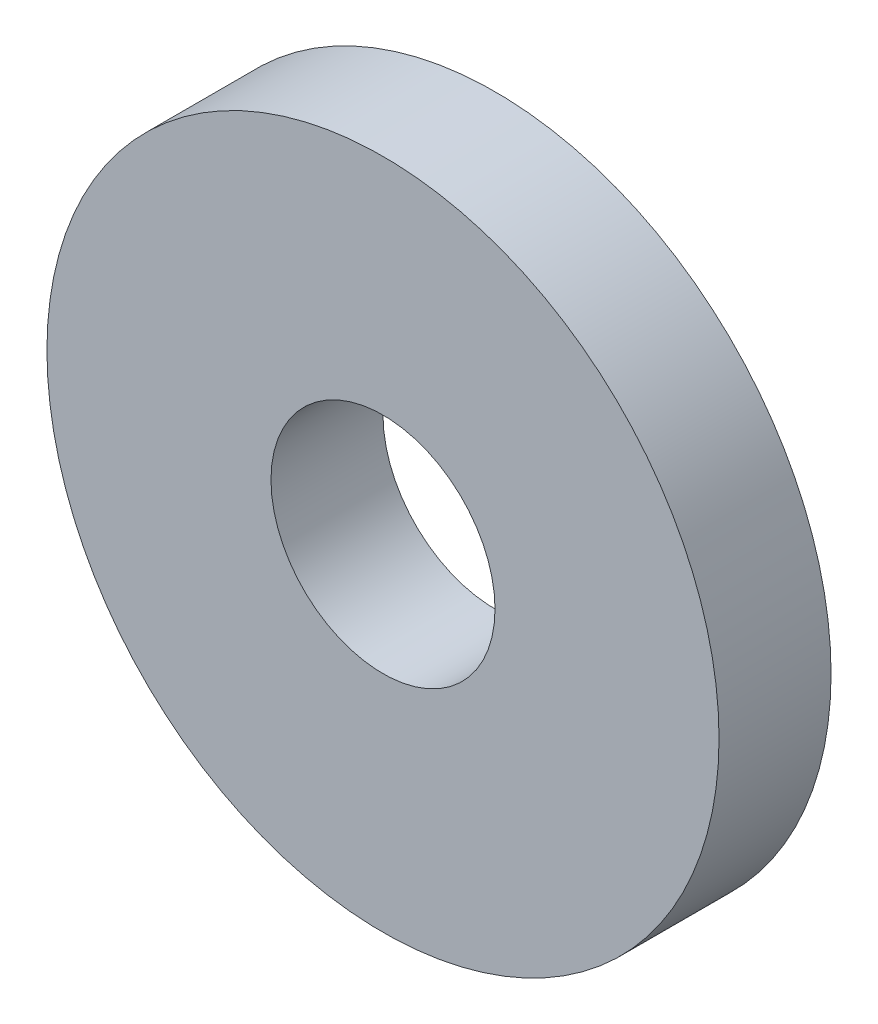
from build123d import *

# Parameters (mm, degrees)
SKETCH1_R           = 3
BOSS_EXTRUDE1_DEPTH = 1
SKETCH2_R           = 1
CUT_EXTRUDE1_DEPTH  = 1


with BuildPart() as part:
    # Sketch1 → Boss-Extrude1 (new body)
    with BuildSketch(Plane.XY):
        Circle(SKETCH1_R)
    extrude(amount=BOSS_EXTRUDE1_DEPTH)

    # Sketch2 → Cut-Extrude1 (cut)
    with BuildSketch(Plane.XY.offset(1)):
        Circle(SKETCH2_R)
    extrude(amount=-CUT_EXTRUDE1_DEPTH, mode=Mode.SUBTRACT)


solid = part.part
